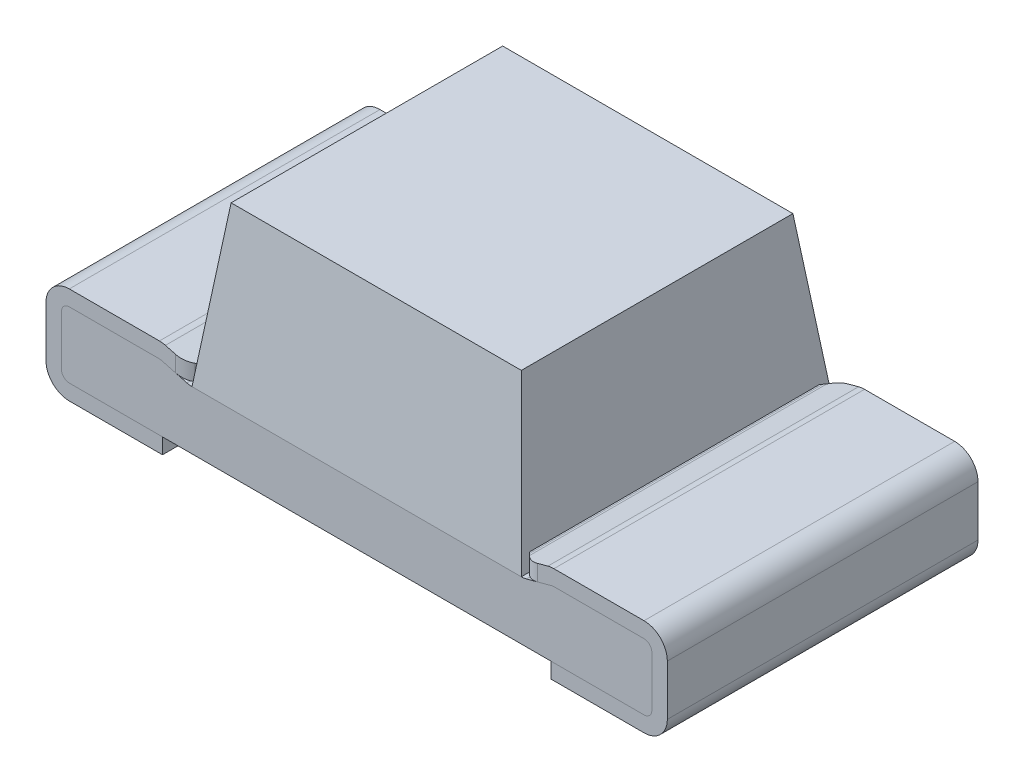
from build123d import *

# Parameters (mm, degrees)
EXTRUDE_1_DEPTH     = 0.4
EXTRUDE1_DEPTH      = 1.923525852
EXTRUDE1_DEPTH_BACK = 1.923525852
FILLET1_R           = 0.05
EXTRUDE_START       = -0.4
EXTRUDE_1_2_DEPTH   = 0.8
SKETCH_4_W          = 0.848084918
SKETCH_4_H          = 0.8
EXTRUDE_2_DEPTH     = 0.41
EXTRUDE_2_TAPER     = 7


with BuildPart() as part:
    # Sketch 2 → Extrude 1 (new, symmetric)
    with BuildSketch(Plane.XY):
        with BuildLine():
            Line((-0.5, 0), (-0.74, 0))
            ThreePointArc((-0.74, 0), (-0.782426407, 0.017573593), (-0.8, 0.06))
            Line((-0.8, 0.06), (-0.8, 0.19))
            ThreePointArc((-0.8, 0.19), (-0.782426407, 0.232426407), (-0.74, 0.25))
            Line((-0.74, 0.25), (-0.50789915, 0.25))
            ThreePointArc((-0.50789915, 0.25), (-0.500067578, 0.249486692), (-0.492370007, 0.24795555))
            Line((-0.492370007, 0.24795555), (-0.427902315, 0.230681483))
            ThreePointArc((-0.427902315, 0.230681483), (-0.425336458, 0.230171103), (-0.422725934, 0.23))
            Line((-0.422725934, 0.23), (0.422725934, 0.23))
            ThreePointArc((0.422725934, 0.23), (0.425336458, 0.230171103), (0.427902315, 0.230681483))
            Line((0.427902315, 0.230681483), (0.492370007, 0.24795555))
            ThreePointArc((0.492370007, 0.24795555), (0.500067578, 0.249486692), (0.50789915, 0.25))
            Line((0.50789915, 0.25), (0.74, 0.25))
            ThreePointArc((0.74, 0.25), (0.782426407, 0.232426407), (0.8, 0.19))
            Line((0.8, 0.19), (0.8, 0.06))
            ThreePointArc((0.8, 0.06), (0.782426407, 0.017573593), (0.74, 0))
            Line((0.74, 0), (0.5, 0))
            Line((0.5, 0), (0.5, 0.04))
            Line((0.5, 0.04), (0.74, 0.04))
            ThreePointArc((0.74, 0.04), (0.754142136, 0.045857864), (0.76, 0.06))
            Line((0.76, 0.06), (0.76, 0.19))
            ThreePointArc((0.76, 0.19), (0.754142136, 0.204142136), (0.74, 0.21))
            Line((0.74, 0.21), (0.50789915, 0.21))
            ThreePointArc((0.50789915, 0.21), (0.505288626, 0.209828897), (0.502722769, 0.209318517))
            Line((0.502722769, 0.209318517), (0.438255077, 0.19204445))
            ThreePointArc((0.438255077, 0.19204445), (0.430557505, 0.190513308), (0.422725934, 0.19))
            Line((0.422725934, 0.19), (-0.422725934, 0.19))
            ThreePointArc((-0.422725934, 0.19), (-0.430557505, 0.190513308), (-0.438255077, 0.19204445))
            Line((-0.438255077, 0.19204445), (-0.502722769, 0.209318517))
            ThreePointArc((-0.502722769, 0.209318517), (-0.505288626, 0.209828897), (-0.50789915, 0.21))
            Line((-0.50789915, 0.21), (-0.74, 0.21))
            ThreePointArc((-0.74, 0.21), (-0.754142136, 0.204142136), (-0.76, 0.19))
            Line((-0.76, 0.19), (-0.76, 0.06))
            ThreePointArc((-0.76, 0.06), (-0.754142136, 0.045857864), (-0.74, 0.04))
            Line((-0.74, 0.04), (-0.5, 0.04))
            Line((-0.5, 0.04), (-0.5, 0))
        make_face()
    extrude(amount=EXTRUDE_1_DEPTH, both=True)

    # Sketch1 → Extrude1 (cut, two sides: drawn at the far end of the back side and taken through both)
    with BuildSketch(Plane(origin=(0, 0.23, 0), x_dir=(1, 0, 0), z_dir=(0, 1, 0)).offset(-EXTRUDE1_DEPTH_BACK)):
        Polygon((-0.445358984, 0.4), (-0.345358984, 0.3), (0.345358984, 0.3), (0.445358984, 0.4), align=None)
        Polygon((0.445358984, -0.4), (0.345358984, -0.3), (-0.345358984, -0.3), (-0.445358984, -0.4), align=None)
    extrude(amount=EXTRUDE1_DEPTH + EXTRUDE1_DEPTH_BACK, mode=Mode.SUBTRACT)

    # Fillet1
    fillet1_edges = [part.edges().sort_by_distance(p)[0] for p in [
        (-0.445358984, 0.21465346, -0.4),
        (0.445358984, 0.21465346, -0.4),
        (0.445358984, 0.21465346, 0.4),
        (-0.445358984, 0.21465346, 0.4),
    ]]
    fillet(fillet1_edges, radius=FILLET1_R)


with BuildPart() as body_2:
    # Sketch 3 → Extrude 1 2 (new body)
    with BuildSketch(Plane.XY.offset(EXTRUDE_START)):
        with BuildLine():
            Line((0.502722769, 0.209318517), (0.436983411, 0.191703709))
            ThreePointArc((0.436983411, 0.191703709), (0.430568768, 0.190427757), (0.424042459, 0.19))
            Line((0.424042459, 0.19), (-0.424042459, 0.19))
            ThreePointArc((-0.424042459, 0.19), (-0.430568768, 0.190427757), (-0.436983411, 0.191703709))
            Line((-0.436983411, 0.191703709), (-0.502722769, 0.209318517))
            ThreePointArc((-0.502722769, 0.209318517), (-0.505288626, 0.209828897), (-0.50789915, 0.21))
            Line((-0.50789915, 0.21), (-0.74, 0.21))
            ThreePointArc((-0.74, 0.21), (-0.754142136, 0.204142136), (-0.76, 0.19))
            Line((-0.76, 0.19), (-0.76, 0.06))
            ThreePointArc((-0.76, 0.06), (-0.754142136, 0.045857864), (-0.74, 0.04))
            Line((-0.74, 0.04), (0.74, 0.04))
            ThreePointArc((0.74, 0.04), (0.754142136, 0.045857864), (0.76, 0.06))
            Line((0.76, 0.06), (0.76, 0.19))
            ThreePointArc((0.76, 0.19), (0.754142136, 0.204142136), (0.74, 0.21))
            Line((0.74, 0.21), (0.50789915, 0.21))
            ThreePointArc((0.50789915, 0.21), (0.505288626, 0.209828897), (0.502722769, 0.209318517))
        make_face()
    extrude(amount=EXTRUDE_1_2_DEPTH)


with BuildPart() as body_3:
    # Sketch 4 → Extrude 2 (new body)
    with BuildSketch(Plane(origin=(0, 0.19, 0), x_dir=(1, 0, 0), z_dir=(0, 1, 0))):
        Rectangle(SKETCH_4_W, SKETCH_4_H)
    extrude(amount=EXTRUDE_2_DEPTH, taper=EXTRUDE_2_TAPER)


solid = Compound([part.part, body_2.part, body_3.part])
